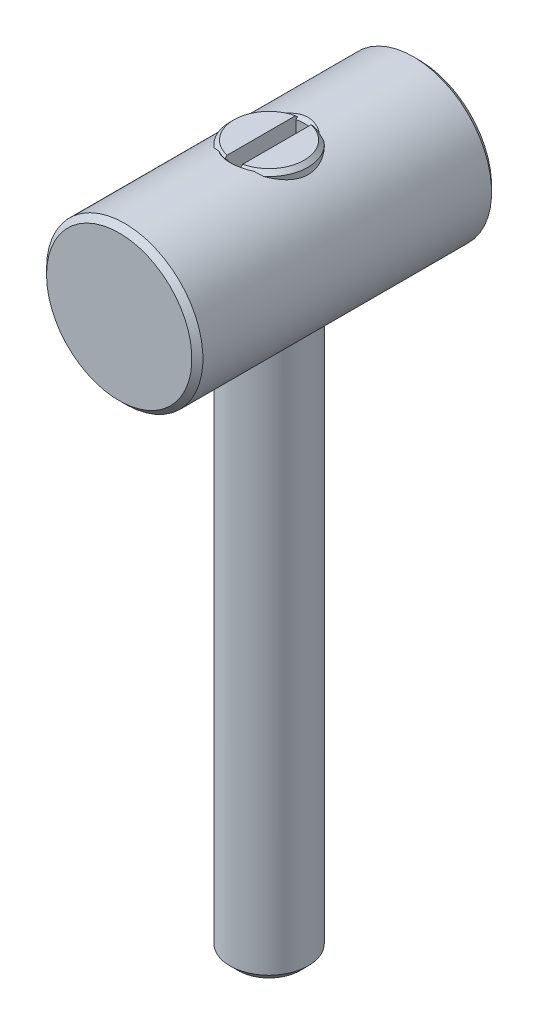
ISO-10303-21;
HEADER;
FILE_DESCRIPTION(('STEP AP214'),'2;1');
FILE_NAME('part.step','',(''),(''),'','','');
FILE_SCHEMA(('AUTOMOTIVE_DESIGN { 1 0 10303 214 1 1 1 1 }'));
ENDSEC;
DATA;
#1=APPLICATION_CONTEXT('core data for automotive mechanical design processes');
#2=APPLICATION_PROTOCOL_DEFINITION('international standard','automotive_design',2000,#1);
#3=PRODUCT_CONTEXT('',#1,'mechanical');
#4=PRODUCT('Part','Part','',(#3));
#5=PRODUCT_RELATED_PRODUCT_CATEGORY('part','',(#4));
#6=PRODUCT_DEFINITION_FORMATION('','',#4);
#7=PRODUCT_DEFINITION_CONTEXT('part definition',#1,'design');
#8=PRODUCT_DEFINITION('design','',#6,#7);
#9=PRODUCT_DEFINITION_SHAPE('','',#8);
#10=(LENGTH_UNIT() NAMED_UNIT(*) SI_UNIT(.MILLI.,.METRE.));
#11=(NAMED_UNIT(*) PLANE_ANGLE_UNIT() SI_UNIT($,.RADIAN.));
#12=(NAMED_UNIT(*) SI_UNIT($,.STERADIAN.) SOLID_ANGLE_UNIT());
#13=UNCERTAINTY_MEASURE_WITH_UNIT(LENGTH_MEASURE(1.E-05),#10,'distance_accuracy_value','');
#14=(GEOMETRIC_REPRESENTATION_CONTEXT(3) GLOBAL_UNCERTAINTY_ASSIGNED_CONTEXT((#13)) GLOBAL_UNIT_ASSIGNED_CONTEXT((#10,
#11,#12)) REPRESENTATION_CONTEXT('',''));
#15=CARTESIAN_POINT('',(0.,0.,0.));
#16=DIRECTION('',(0.,0.,1.));
#17=DIRECTION('',(1.,0.,0.));
#18=AXIS2_PLACEMENT_3D('',#15,#16,#17);
#19=CARTESIAN_POINT('',(0.,-4.,0.));
#20=DIRECTION('',(0.,-1.,0.));
#21=DIRECTION('',(-1.,0.,0.));
#22=AXIS2_PLACEMENT_3D('',#19,#20,#21);
#23=CYLINDRICAL_SURFACE('',#22,1.5);
#24=CARTESIAN_POINT('',(0.947331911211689,2.8465,-1.16299709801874));
#25=CARTESIAN_POINT('',(1.01351143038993,2.82450537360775,-1.10908406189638));
#26=CARTESIAN_POINT('',(1.07489527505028,2.80147999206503,-1.04969000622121));
#27=CARTESIAN_POINT('',(1.18710041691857,2.75580128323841,-0.920938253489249));
#28=CARTESIAN_POINT('',(1.2378650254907,2.73315051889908,-0.851530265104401));
#29=CARTESIAN_POINT('',(1.32722551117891,2.69089876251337,-0.704204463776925));
#30=CARTESIAN_POINT('',(1.36579908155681,2.67130339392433,-0.626271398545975));
#31=CARTESIAN_POINT('',(1.42909401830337,2.63798775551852,-0.46394540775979));
#32=CARTESIAN_POINT('',(1.45385048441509,2.62425262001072,-0.379569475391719));
#33=CARTESIAN_POINT('',(1.48697739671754,2.60561664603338,-0.213368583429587));
#34=CARTESIAN_POINT('',(1.49644089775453,2.60012870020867,-0.131829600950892));
#35=CARTESIAN_POINT('',(1.5018928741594,2.59698536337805,0.0318566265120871));
#36=CARTESIAN_POINT('',(1.49788424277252,2.59932829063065,0.114003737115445));
#37=CARTESIAN_POINT('',(1.47773438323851,2.61082510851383,0.267779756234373));
#38=CARTESIAN_POINT('',(1.4628558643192,2.61926920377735,0.339634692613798));
#39=CARTESIAN_POINT('',(1.42308110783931,2.64108893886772,0.47973567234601));
#40=CARTESIAN_POINT('',(1.39818007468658,2.65446693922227,0.547979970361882));
#41=CARTESIAN_POINT('',(1.33746138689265,2.68559571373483,0.683395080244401));
#42=CARTESIAN_POINT('',(1.30108662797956,2.70355780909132,0.750265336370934));
#43=CARTESIAN_POINT('',(1.21901847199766,2.74153817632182,0.877331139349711));
#44=CARTESIAN_POINT('',(1.17332890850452,2.76155560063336,0.93752941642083));
#45=CARTESIAN_POINT('',(1.09644538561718,2.79260769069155,1.02443697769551));
#46=CARTESIAN_POINT('',(1.06820925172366,2.80355315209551,1.05384666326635));
#47=CARTESIAN_POINT('',(1.00945808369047,2.82523876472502,1.11024632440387));
#48=CARTESIAN_POINT('',(0.978947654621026,2.83597927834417,1.13724095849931));
#49=CARTESIAN_POINT('',(0.947331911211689,2.8465,1.16299709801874));
#50=B_SPLINE_CURVE_WITH_KNOTS('',3,(#24,#25,#26,#27,#28,#29,#30,#31,#32,#33,#34,#35,#36,#37,#38,
#39,#40,#41,#42,#43,#44,#45,#46,#47,#48,#49),.UNSPECIFIED.,.F.,.F.,(4,2,2,2,2,2,2,2,2,2,2,2,4),
(0.,0.264174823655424,0.529725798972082,0.79575989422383,1.06111506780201,1.30649824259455,
1.55182872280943,1.77244859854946,1.99317416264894,2.22691434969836,2.46055853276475,
2.58708455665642,2.71336100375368),.UNSPECIFIED.);
#51=CARTESIAN_POINT('',(0.947331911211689,2.8465,-1.16299709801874));
#52=VERTEX_POINT('',#51);
#53=CARTESIAN_POINT('',(0.947331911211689,2.8465,1.16299709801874));
#54=VERTEX_POINT('',#53);
#55=EDGE_CURVE('E189',#52,#54,#50,.T.);
#56=ORIENTED_EDGE('',*,*,#55,.F.);
#57=CARTESIAN_POINT('',(0.,2.8465,0.));
#58=DIRECTION('',(0.,-1.,0.));
#59=DIRECTION('',(-1.,0.,0.));
#60=AXIS2_PLACEMENT_3D('',#57,#58,#59);
#61=CIRCLE('',#60,1.5);
#62=EDGE_CURVE('E245',#52,#54,#61,.T.);
#63=ORIENTED_EDGE('',*,*,#62,.T.);
#64=EDGE_LOOP('',(#56,#63));
#65=FACE_BOUND('',#64,.T.);
#66=ADVANCED_FACE('F14',(#65),#23,.T.);
#67=CARTESIAN_POINT('',(0.,3.,0.));
#68=DIRECTION('',(0.,-1.,0.));
#69=DIRECTION('',(-1.,0.,0.));
#70=AXIS2_PLACEMENT_3D('',#67,#68,#69);
#71=PLANE('',#70);
#72=DIRECTION('',(0.,0.,1.));
#73=VECTOR('',#72,1.);
#74=CARTESIAN_POINT('',(-0.3,3.,0.));
#75=LINE('',#74,#73);
#76=CARTESIAN_POINT('',(-0.3,3.,-1.31265465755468));
#77=VERTEX_POINT('',#76);
#78=CARTESIAN_POINT('',(-0.3,3.,1.31265465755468));
#79=VERTEX_POINT('',#78);
#80=EDGE_CURVE('E41',#77,#79,#75,.T.);
#81=ORIENTED_EDGE('',*,*,#80,.F.);
#82=CARTESIAN_POINT('',(0.,3.,0.));
#83=DIRECTION('',(0.,-1.,0.));
#84=DIRECTION('',(-1.,0.,0.));
#85=AXIS2_PLACEMENT_3D('',#82,#83,#84);
#86=CIRCLE('',#85,1.3465);
#87=EDGE_CURVE('E272',#79,#77,#86,.T.);
#88=ORIENTED_EDGE('',*,*,#87,.F.);
#89=EDGE_LOOP('',(#81,#88));
#90=FACE_BOUND('',#89,.T.);
#91=ADVANCED_FACE('F217',(#90),#71,.F.);
#92=CARTESIAN_POINT('',(0.,3.,0.));
#93=DIRECTION('',(0.,-1.,0.));
#94=DIRECTION('',(-1.,0.,0.));
#95=AXIS2_PLACEMENT_3D('',#92,#93,#94);
#96=CONICAL_SURFACE('',#95,1.3465,0.785398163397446);
#97=CARTESIAN_POINT('',(-0.992835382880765,2.83095,-1.14506318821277));
#98=CARTESIAN_POINT('',(-0.929590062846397,2.85313590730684,-1.17057691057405));
#99=CARTESIAN_POINT('',(-0.864893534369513,2.87343844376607,-1.19430901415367));
#100=CARTESIAN_POINT('',(-0.733580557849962,2.90971649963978,-1.23716783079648));
#101=CARTESIAN_POINT('',(-0.666989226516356,2.92573258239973,-1.25633751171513));
#102=CARTESIAN_POINT('',(-0.531496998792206,2.95335159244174,-1.28959120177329));
#103=CARTESIAN_POINT('',(-0.46259234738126,2.96494692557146,-1.30366645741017));
#104=CARTESIAN_POINT('',(-0.322550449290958,2.98346059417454,-1.32622709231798));
#105=CARTESIAN_POINT('',(-0.251397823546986,2.99033132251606,-1.33465555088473));
#106=CARTESIAN_POINT('',(-0.1798,2.99460714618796,-1.33988292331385));
#107=B_SPLINE_CURVE_WITH_KNOTS('',3,(#97,#98,#99,#100,#101,#102,#103,#104,#105,#106),
.UNSPECIFIED.,.F.,.F.,(4,2,2,2,4),(0.,0.215180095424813,0.428245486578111,0.64167525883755,
0.85722531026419),.UNSPECIFIED.);
#108=CARTESIAN_POINT('',(-0.947331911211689,2.8465,-1.16299709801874));
#109=VERTEX_POINT('',#108);
#110=CARTESIAN_POINT('',(-0.674247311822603,2.92325,-1.25340780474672));
#111=VERTEX_POINT('',#110);
#112=EDGE_CURVE('E113',#109,#111,#107,.T.);
#113=ORIENTED_EDGE('',*,*,#112,.F.);
#114=CARTESIAN_POINT('',(-0.947331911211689,2.8465,1.16299709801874));
#115=VERTEX_POINT('',#114);
#116=EDGE_CURVE('E243',#115,#109,#61,.T.);
#117=ORIENTED_EDGE('',*,*,#116,.F.);
#118=CARTESIAN_POINT('',(-0.1798,2.99460714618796,1.33988292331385));
#119=CARTESIAN_POINT('',(-0.236038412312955,2.99124022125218,1.335761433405));
#120=CARTESIAN_POINT('',(-0.292017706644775,2.9862800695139,1.3296804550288));
#121=CARTESIAN_POINT('',(-0.403063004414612,2.97332250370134,1.31386344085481));
#122=CARTESIAN_POINT('',(-0.458129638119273,2.96532728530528,1.30413004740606));
#123=CARTESIAN_POINT('',(-0.56626748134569,2.94657689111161,1.28142693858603));
#124=CARTESIAN_POINT('',(-0.619355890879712,2.93586230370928,1.26850488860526));
#125=CARTESIAN_POINT('',(-0.724099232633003,2.91179776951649,1.23969917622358));
#126=CARTESIAN_POINT('',(-0.775754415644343,2.89844828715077,1.22381603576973));
#127=CARTESIAN_POINT('',(-0.854754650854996,2.87580466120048,1.1971455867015));
#128=CARTESIAN_POINT('',(-0.882653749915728,2.86736203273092,1.18725045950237));
#129=CARTESIAN_POINT('',(-0.93806639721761,2.8497157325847,1.16670181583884));
#130=CARTESIAN_POINT('',(-0.96557794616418,2.84050913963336,1.15604541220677));
#131=CARTESIAN_POINT('',(-0.992835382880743,2.83095,1.14506318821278));
#132=B_SPLINE_CURVE_WITH_KNOTS('',3,(#118,#119,#120,#121,#122,#123,#124,#125,#126,#127,#128,
#129,#130,#131),.UNSPECIFIED.,.F.,.F.,(4,2,2,2,2,2,4),(0.,0.169384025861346,0.338645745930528,
0.505516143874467,0.672357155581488,0.764685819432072,0.857385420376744),.UNSPECIFIED.);
#133=CARTESIAN_POINT('',(-0.674247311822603,2.92325,1.25340780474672));
#134=VERTEX_POINT('',#133);
#135=EDGE_CURVE('E119',#134,#115,#132,.T.);
#136=ORIENTED_EDGE('',*,*,#135,.F.);
#137=CARTESIAN_POINT('',(0.,2.92325,0.));
#138=DIRECTION('',(0.,1.,0.));
#139=DIRECTION('',(0.,0.,1.));
#140=AXIS2_PLACEMENT_3D('',#137,#138,#139);
#141=CIRCLE('',#140,1.42325);
#142=CARTESIAN_POINT('',(-0.3,2.92325,1.39127300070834));
#143=VERTEX_POINT('',#142);
#144=EDGE_CURVE('E275',#134,#143,#141,.T.);
#145=ORIENTED_EDGE('',*,*,#144,.T.);
#146=CARTESIAN_POINT('',(-0.3,2.8458,-1.4704082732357));
#147=CARTESIAN_POINT('',(-0.3,2.88115643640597,-1.43432199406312));
#148=CARTESIAN_POINT('',(-0.3,2.91648779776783,-1.39821111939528));
#149=CARTESIAN_POINT('',(-0.3,2.98714018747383,-1.32586601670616));
#150=CARTESIAN_POINT('',(-0.3,3.0224611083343,-1.28963168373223));
#151=CARTESIAN_POINT('',(-0.3,3.09397621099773,-1.21609681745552));
#152=CARTESIAN_POINT('',(-0.3,3.13016808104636,-1.1787940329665));
#153=CARTESIAN_POINT('',(-0.3,3.20237441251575,-1.10413383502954));
#154=CARTESIAN_POINT('',(-0.3,3.23838906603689,-1.06677660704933));
#155=CARTESIAN_POINT('',(-0.3,3.34146505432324,-0.959421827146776));
#156=CARTESIAN_POINT('',(-0.3,3.40833744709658,-0.889241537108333));
#157=CARTESIAN_POINT('',(-0.3,3.50808269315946,-0.78299989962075));
#158=CARTESIAN_POINT('',(-0.3,3.54134564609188,-0.747305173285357));
#159=CARTESIAN_POINT('',(-0.3,3.6074459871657,-0.675572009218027));
#160=CARTESIAN_POINT('',(-0.3,3.64028367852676,-0.639533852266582));
#161=CARTESIAN_POINT('',(-0.3,3.70448937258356,-0.567825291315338));
#162=CARTESIAN_POINT('',(-0.3,3.73587344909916,-0.53216929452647));
#163=CARTESIAN_POINT('',(-0.3,3.79773982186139,-0.459887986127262));
#164=CARTESIAN_POINT('',(-0.3,3.82821923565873,-0.423260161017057));
#165=CARTESIAN_POINT('',(-0.3,3.8723076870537,-0.367400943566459));
#166=CARTESIAN_POINT('',(-0.3,3.88664675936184,-0.348748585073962));
#167=CARTESIAN_POINT('',(-0.3,3.91462683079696,-0.310930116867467));
#168=CARTESIAN_POINT('',(-0.3,3.92826804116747,-0.291764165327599));
#169=CARTESIAN_POINT('',(-0.3,3.95444414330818,-0.252814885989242));
#170=CARTESIAN_POINT('',(-0.3,3.96698388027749,-0.233034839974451));
#171=CARTESIAN_POINT('',(-0.3,3.99041713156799,-0.192530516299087));
#172=CARTESIAN_POINT('',(-0.3,4.00131370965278,-0.171808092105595));
#173=CARTESIAN_POINT('',(-0.3,4.01290967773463,-0.145940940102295));
#174=CARTESIAN_POINT('',(-0.3,4.01488714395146,-0.141366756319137));
#175=CARTESIAN_POINT('',(-0.3,4.01870640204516,-0.132159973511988));
#176=CARTESIAN_POINT('',(-0.3,4.02054813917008,-0.127527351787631));
#177=CARTESIAN_POINT('',(-0.3,4.02584745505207,-0.113544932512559));
#178=CARTESIAN_POINT('',(-0.3,4.02908025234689,-0.104108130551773));
#179=CARTESIAN_POINT('',(-0.3,4.03477287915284,-0.08516895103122));
#180=CARTESIAN_POINT('',(-0.3,4.03724447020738,-0.0756701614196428));
#181=CARTESIAN_POINT('',(-0.3,4.04137161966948,-0.0564948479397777));
#182=CARTESIAN_POINT('',(-0.3,4.04302692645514,-0.0468182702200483));
#183=CARTESIAN_POINT('',(-0.3,4.04664228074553,-0.0172377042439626));
#184=CARTESIAN_POINT('',(-0.3,4.04714068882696,0.00287379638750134));
#185=CARTESIAN_POINT('',(-0.3,4.04412319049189,0.0428030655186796));
#186=CARTESIAN_POINT('',(-0.3,4.0405978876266,0.0626200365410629));
#187=CARTESIAN_POINT('',(-0.3,4.02858082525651,0.108260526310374));
#188=CARTESIAN_POINT('',(-0.3,4.01877038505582,0.133719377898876));
#189=CARTESIAN_POINT('',(-0.3,4.00150485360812,0.170708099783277));
#190=CARTESIAN_POINT('',(-0.3,3.9952966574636,0.182880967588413));
#191=CARTESIAN_POINT('',(-0.3,3.98222681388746,0.206871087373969));
#192=CARTESIAN_POINT('',(-0.3,3.97536538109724,0.218688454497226));
#193=CARTESIAN_POINT('',(-0.3,3.95218871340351,0.256757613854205));
#194=CARTESIAN_POINT('',(-0.3,3.93487575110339,0.282394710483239));
#195=CARTESIAN_POINT('',(-0.3,3.89886611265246,0.332686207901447));
#196=CARTESIAN_POINT('',(-0.3,3.8801680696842,0.357339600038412));
#197=CARTESIAN_POINT('',(-0.3,3.84187863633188,0.40604123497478));
#198=CARTESIAN_POINT('',(-0.3,3.82228508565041,0.430087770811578));
#199=CARTESIAN_POINT('',(-0.3,3.78254416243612,0.477720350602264));
#200=CARTESIAN_POINT('',(-0.3,3.76239671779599,0.501306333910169));
#201=CARTESIAN_POINT('',(-0.3,3.70125985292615,0.571740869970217));
#202=CARTESIAN_POINT('',(-0.3,3.65970988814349,0.618101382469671));
#203=CARTESIAN_POINT('',(-0.3,3.57590945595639,0.710039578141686));
#204=CARTESIAN_POINT('',(-0.3,3.53366022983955,0.75561840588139));
#205=CARTESIAN_POINT('',(-0.3,3.43788259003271,0.857897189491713));
#206=CARTESIAN_POINT('',(-0.3,3.38422190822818,0.914473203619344));
#207=CARTESIAN_POINT('',(-0.3,3.27645519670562,1.02726219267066));
#208=CARTESIAN_POINT('',(-0.3,3.22234892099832,1.08347493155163));
#209=CARTESIAN_POINT('',(-0.3,3.11457978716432,1.19491746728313));
#210=CARTESIAN_POINT('',(-0.3,3.06092031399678,1.25015053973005));
#211=CARTESIAN_POINT('',(-0.3,2.95345728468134,1.36040840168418));
#212=CARTESIAN_POINT('',(-0.3,2.8996538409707,1.41543330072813));
#213=CARTESIAN_POINT('',(-0.3,2.8458,1.4704082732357));
#214=B_SPLINE_CURVE_WITH_KNOTS('',3,(#146,#147,#148,#149,#150,#151,#152,#153,#154,#155,#156,
#157,#158,#159,#160,#161,#162,#163,#164,#165,#166,#167,#168,#169,#170,#171,#172,#173,#174,#175,
#176,#177,#178,#179,#180,#181,#182,#183,#184,#185,#186,#187,#188,#189,#190,#191,#192,#193,#194,
#195,#196,#197,#198,#199,#200,#201,#202,#203,#204,#205,#206,#207,#208,#209,#210,#211,#212,#213),
.UNSPECIFIED.,.F.,.F.,(4,2,2,2,2,2,2,2,2,2,2,2,2,2,2,2,2,2,2,2,2,2,2,2,2,2,2,2,2,2,2,2,2,4),(0.,
0.151560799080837,0.303364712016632,0.459287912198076,0.61495934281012,0.905769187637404,
1.05213984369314,1.19839964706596,1.34089509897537,1.48380422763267,1.5543752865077,
1.62492485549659,1.6951466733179,1.76523589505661,1.78018397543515,1.79513805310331,
1.82503814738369,1.85444992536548,1.88387076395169,1.94377833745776,2.00382609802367,
2.08518752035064,2.12617578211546,2.16715062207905,2.25986253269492,2.35266718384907,
2.44570893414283,2.53876285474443,2.72550711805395,2.91194943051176,3.14587396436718,
3.37993768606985,3.6109572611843,3.84183089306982),.UNSPECIFIED.);
#215=EDGE_CURVE('E240',#79,#143,#214,.T.);
#216=ORIENTED_EDGE('',*,*,#215,.F.);
#217=ORIENTED_EDGE('',*,*,#87,.T.);
#218=CARTESIAN_POINT('',(-0.3,2.92325,-1.39127300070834));
#219=VERTEX_POINT('',#218);
#220=EDGE_CURVE('E37',#219,#77,#214,.T.);
#221=ORIENTED_EDGE('',*,*,#220,.F.);
#222=CARTESIAN_POINT('',(0.,2.92325,0.));
#223=DIRECTION('',(0.,1.,0.));
#224=DIRECTION('',(0.,0.,1.));
#225=AXIS2_PLACEMENT_3D('',#222,#223,#224);
#226=CIRCLE('',#225,1.42325);
#227=EDGE_CURVE('E109',#219,#111,#226,.T.);
#228=ORIENTED_EDGE('',*,*,#227,.T.);
#229=EDGE_LOOP('',(#113,#117,#136,#145,#216,#217,#221,#228));
#230=FACE_BOUND('',#229,.T.);
#231=ADVANCED_FACE('F111',(#230),#96,.T.);
#232=CARTESIAN_POINT('',(0.3,33.3,0.));
#233=DIRECTION('',(-1.,0.,0.));
#234=DIRECTION('',(0.,0.,1.));
#235=AXIS2_PLACEMENT_3D('',#232,#233,#234);
#236=CYLINDRICAL_SURFACE('',#235,31.5);
#237=CARTESIAN_POINT('',(0.3,1.82813733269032,1.33111241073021));
#238=CARTESIAN_POINT('',(0.262266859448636,1.8284977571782,1.33962103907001));
#239=CARTESIAN_POINT('',(0.224170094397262,1.82879235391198,1.34651682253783));
#240=CARTESIAN_POINT('',(0.14752354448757,1.82924457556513,1.35705208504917));
#241=CARTESIAN_POINT('',(0.108973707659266,1.82940218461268,1.36069118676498));
#242=CARTESIAN_POINT('',(0.0324105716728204,1.82957344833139,1.36464401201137));
#243=CARTESIAN_POINT('',(-0.00559964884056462,1.82958968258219,1.3650173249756));
#244=CARTESIAN_POINT('',(-0.0815076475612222,1.82948446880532,1.36259212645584));
#245=CARTESIAN_POINT('',(-0.119405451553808,1.82936305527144,1.35979440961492));
#246=CARTESIAN_POINT('',(-0.205128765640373,1.82893560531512,1.34986012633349));
#247=CARTESIAN_POINT('',(-0.252842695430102,1.8285882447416,1.34174825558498));
#248=CARTESIAN_POINT('',(-0.3,1.82813733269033,1.33111241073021));
#249=B_SPLINE_CURVE_WITH_KNOTS('',3,(#237,#238,#239,#240,#241,#242,#243,#244,#245,#246,#247,
#248),.UNSPECIFIED.,.F.,.F.,(4,2,2,2,2,4),(0.,0.116010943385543,0.232035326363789,
0.345938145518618,0.459812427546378,0.604746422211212),.UNSPECIFIED.);
#250=CARTESIAN_POINT('',(0.3,1.82813733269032,1.33111241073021));
#251=VERTEX_POINT('',#250);
#252=CARTESIAN_POINT('',(-0.3,1.82813733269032,1.33111241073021));
#253=VERTEX_POINT('',#252);
#254=EDGE_CURVE('E301',#251,#253,#249,.T.);
#255=ORIENTED_EDGE('',*,*,#254,.F.);
#256=CARTESIAN_POINT('',(0.3,33.3,0.));
#257=DIRECTION('',(1.,0.,0.));
#258=DIRECTION('',(0.,0.,-1.));
#259=AXIS2_PLACEMENT_3D('',#256,#257,#258);
#260=CIRCLE('',#259,31.5);
#261=CARTESIAN_POINT('',(0.3,1.82813733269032,-1.33111241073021));
#262=VERTEX_POINT('',#261);
#263=EDGE_CURVE('E139',#251,#262,#260,.T.);
#264=ORIENTED_EDGE('',*,*,#263,.T.);
#265=CARTESIAN_POINT('',(-0.3,1.82813733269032,-1.33111241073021));
#266=CARTESIAN_POINT('',(-0.262266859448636,1.8284977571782,-1.33962103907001));
#267=CARTESIAN_POINT('',(-0.224170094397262,1.82879235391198,-1.34651682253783));
#268=CARTESIAN_POINT('',(-0.14752354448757,1.82924457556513,-1.35705208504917));
#269=CARTESIAN_POINT('',(-0.108973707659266,1.82940218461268,-1.36069118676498));
#270=CARTESIAN_POINT('',(-0.0324105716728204,1.82957344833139,-1.36464401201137));
#271=CARTESIAN_POINT('',(0.00559964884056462,1.82958968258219,-1.3650173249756));
#272=CARTESIAN_POINT('',(0.0815076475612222,1.82948446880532,-1.36259212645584));
#273=CARTESIAN_POINT('',(0.119405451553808,1.82936305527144,-1.35979440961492));
#274=CARTESIAN_POINT('',(0.205128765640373,1.82893560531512,-1.34986012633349));
#275=CARTESIAN_POINT('',(0.252842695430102,1.8285882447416,-1.34174825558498));
#276=CARTESIAN_POINT('',(0.3,1.82813733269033,-1.33111241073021));
#277=B_SPLINE_CURVE_WITH_KNOTS('',3,(#265,#266,#267,#268,#269,#270,#271,#272,#273,#274,#275,
#276),.UNSPECIFIED.,.F.,.F.,(4,2,2,2,2,4),(0.,0.116010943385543,0.232035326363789,
0.345938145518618,0.459812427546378,0.604746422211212),.UNSPECIFIED.);
#278=CARTESIAN_POINT('',(-0.3,1.82813733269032,-1.33111241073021));
#279=VERTEX_POINT('',#278);
#280=EDGE_CURVE('E146',#279,#262,#277,.T.);
#281=ORIENTED_EDGE('',*,*,#280,.F.);
#282=CARTESIAN_POINT('',(-0.3,33.3,0.));
#283=DIRECTION('',(1.,0.,0.));
#284=DIRECTION('',(0.,0.,-1.));
#285=AXIS2_PLACEMENT_3D('',#282,#283,#284);
#286=CIRCLE('',#285,31.5);
#287=EDGE_CURVE('E134',#253,#279,#286,.T.);
#288=ORIENTED_EDGE('',*,*,#287,.F.);
#289=EDGE_LOOP('',(#255,#264,#281,#288));
#290=FACE_BOUND('',#289,.T.);
#291=ADVANCED_FACE('F216',(#290),#236,.F.);
#292=CARTESIAN_POINT('',(-0.3,33.3,0.));
#293=DIRECTION('',(1.,0.,0.));
#294=DIRECTION('',(0.,0.,-1.));
#295=AXIS2_PLACEMENT_3D('',#292,#293,#294);
#296=PLANE('',#295);
#297=CARTESIAN_POINT('',(-0.3,2.23530206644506,0.671318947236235));
#298=CARTESIAN_POINT('',(-0.3,2.25951576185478,0.697833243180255));
#299=CARTESIAN_POINT('',(-0.3,2.28385163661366,0.724235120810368));
#300=CARTESIAN_POINT('',(-0.3,2.33271486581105,0.776860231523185));
#301=CARTESIAN_POINT('',(-0.3,2.35724221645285,0.803083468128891));
#302=CARTESIAN_POINT('',(-0.3,2.43103122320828,0.881553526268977));
#303=CARTESIAN_POINT('',(-0.3,2.48050219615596,0.933603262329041));
#304=CARTESIAN_POINT('',(-0.3,2.57977835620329,1.03737516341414));
#305=CARTESIAN_POINT('',(-0.3,2.62958351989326,1.08909735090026));
#306=CARTESIAN_POINT('',(-0.3,2.72941861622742,1.19232568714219));
#307=CARTESIAN_POINT('',(-0.3,2.77944855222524,1.24383183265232));
#308=CARTESIAN_POINT('',(-0.3,2.94833708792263,1.41719880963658));
#309=CARTESIAN_POINT('',(-0.3,3.06754094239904,1.53872304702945));
#310=CARTESIAN_POINT('',(-0.3,3.24664716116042,1.72072148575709));
#311=CARTESIAN_POINT('',(-0.3,3.30640150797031,1.78134186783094));
#312=CARTESIAN_POINT('',(-0.3,3.42598789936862,1.9025053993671));
#313=CARTESIAN_POINT('',(-0.3,3.4858199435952,1.9630485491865));
#314=CARTESIAN_POINT('',(-0.3,3.54568061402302,2.02356348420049));
#315=B_SPLINE_CURVE_WITH_KNOTS('',3,(#297,#298,#299,#300,#301,#302,#303,#304,#305,#306,#307,
#308,#309,#310,#311,#312,#313,#314),.UNSPECIFIED.,.F.,.F.,(4,2,2,2,2,2,2,2,4),(0.,
0.107719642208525,0.215437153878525,0.430861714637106,0.646271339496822,0.861684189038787,
1.37236666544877,1.62772666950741,1.88308548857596),.UNSPECIFIED.);
#316=CARTESIAN_POINT('',(-0.3,2.8645,1.33111241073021));
#317=VERTEX_POINT('',#316);
#318=EDGE_CURVE('E255',#317,#143,#315,.T.);
#319=ORIENTED_EDGE('',*,*,#318,.F.);
#320=DIRECTION('',(0.,-1.,0.));
#321=VECTOR('',#320,1.);
#322=CARTESIAN_POINT('',(-0.3,-3.,1.33111241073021));
#323=LINE('',#322,#321);
#324=EDGE_CURVE('E210',#253,#317,#323,.F.);
#325=ORIENTED_EDGE('',*,*,#324,.F.);
#326=ORIENTED_EDGE('',*,*,#287,.T.);
#327=DIRECTION('',(0.,-1.,0.));
#328=VECTOR('',#327,1.);
#329=CARTESIAN_POINT('',(-0.3,-3.,-1.33111241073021));
#330=LINE('',#329,#328);
#331=CARTESIAN_POINT('',(-0.3,2.8645,-1.33111241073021));
#332=VERTEX_POINT('',#331);
#333=EDGE_CURVE('E246',#332,#279,#330,.T.);
#334=ORIENTED_EDGE('',*,*,#333,.F.);
#335=CARTESIAN_POINT('',(-0.3,3.54348929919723,-2.02134819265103));
#336=CARTESIAN_POINT('',(-0.3,3.48857377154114,-1.96583089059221));
#337=CARTESIAN_POINT('',(-0.3,3.43368230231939,-1.91028984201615));
#338=CARTESIAN_POINT('',(-0.3,3.32396337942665,-1.79914422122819));
#339=CARTESIAN_POINT('',(-0.3,3.26913592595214,-1.74353964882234));
#340=CARTESIAN_POINT('',(-0.3,3.10478055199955,-1.57661382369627));
#341=CARTESIAN_POINT('',(-0.3,2.99537298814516,-1.46517376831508));
#342=CARTESIAN_POINT('',(-0.3,2.83172644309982,-1.29755058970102));
#343=CARTESIAN_POINT('',(-0.3,2.77725282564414,-1.241596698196));
#344=CARTESIAN_POINT('',(-0.3,2.66854234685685,-1.1294608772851));
#345=CARTESIAN_POINT('',(-0.3,2.6143054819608,-1.07327895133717));
#346=CARTESIAN_POINT('',(-0.3,2.506191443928,-0.960561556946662));
#347=CARTESIAN_POINT('',(-0.3,2.45231429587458,-0.904026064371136));
#348=CARTESIAN_POINT('',(-0.3,2.37196128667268,-0.81878330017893));
#349=CARTESIAN_POINT('',(-0.3,2.34525340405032,-0.790295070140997));
#350=CARTESIAN_POINT('',(-0.3,2.29205508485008,-0.733115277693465));
#351=CARTESIAN_POINT('',(-0.3,2.26556465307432,-0.70442371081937));
#352=CARTESIAN_POINT('',(-0.3,2.23921490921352,-0.675602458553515));
#353=B_SPLINE_CURVE_WITH_KNOTS('',3,(#335,#336,#337,#338,#339,#340,#341,#342,#343,#344,#345,
#346,#347,#348,#349,#350,#351,#352),.UNSPECIFIED.,.F.,.F.,(4,2,2,2,2,2,2,2,4),(0.,
0.234266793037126,0.468534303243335,0.937041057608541,1.17131374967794,1.40558290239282,
1.63986822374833,1.75701676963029,1.87416789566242),.UNSPECIFIED.);
#354=EDGE_CURVE('E248',#219,#332,#353,.T.);
#355=ORIENTED_EDGE('',*,*,#354,.F.);
#356=ORIENTED_EDGE('',*,*,#220,.T.);
#357=ORIENTED_EDGE('',*,*,#80,.T.);
#358=ORIENTED_EDGE('',*,*,#215,.T.);
#359=EDGE_LOOP('',(#319,#325,#326,#334,#355,#356,#357,#358));
#360=FACE_BOUND('',#359,.T.);
#361=ADVANCED_FACE('F162',(#360),#296,.T.);
#362=CARTESIAN_POINT('',(0.3,3.,-1.31265465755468));
#363=VERTEX_POINT('',#362);
#364=CARTESIAN_POINT('',(0.3,3.,1.31265465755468));
#365=VERTEX_POINT('',#364);
#366=EDGE_CURVE('E247',#363,#365,#86,.T.);
#367=ORIENTED_EDGE('',*,*,#366,.F.);
#368=DIRECTION('',(0.,0.,1.));
#369=VECTOR('',#368,1.);
#370=CARTESIAN_POINT('',(0.3,3.,0.));
#371=LINE('',#370,#369);
#372=EDGE_CURVE('E241',#363,#365,#371,.T.);
#373=ORIENTED_EDGE('',*,*,#372,.T.);
#374=EDGE_LOOP('',(#367,#373));
#375=FACE_BOUND('',#374,.T.);
#376=ADVANCED_FACE('F219',(#375),#71,.F.);
#377=CARTESIAN_POINT('',(0.1798,2.99460714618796,-1.33988292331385));
#378=CARTESIAN_POINT('',(0.236038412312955,2.99124022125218,-1.335761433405));
#379=CARTESIAN_POINT('',(0.292017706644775,2.9862800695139,-1.3296804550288));
#380=CARTESIAN_POINT('',(0.403063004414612,2.97332250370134,-1.31386344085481));
#381=CARTESIAN_POINT('',(0.458129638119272,2.96532728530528,-1.30413004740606));
#382=CARTESIAN_POINT('',(0.566267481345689,2.94657689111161,-1.28142693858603));
#383=CARTESIAN_POINT('',(0.619355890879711,2.93586230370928,-1.26850488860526));
#384=CARTESIAN_POINT('',(0.724099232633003,2.91179776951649,-1.23969917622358));
#385=CARTESIAN_POINT('',(0.775754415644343,2.89844828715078,-1.22381603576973));
#386=CARTESIAN_POINT('',(0.854754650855,2.87580466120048,-1.1971455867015));
#387=CARTESIAN_POINT('',(0.882653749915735,2.86736203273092,-1.18725045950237));
#388=CARTESIAN_POINT('',(0.938066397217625,2.8497157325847,-1.16670181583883));
#389=CARTESIAN_POINT('',(0.965577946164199,2.84050913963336,-1.15604541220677));
#390=CARTESIAN_POINT('',(0.992835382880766,2.83095,-1.14506318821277));
#391=B_SPLINE_CURVE_WITH_KNOTS('',3,(#377,#378,#379,#380,#381,#382,#383,#384,#385,#386,#387,
#388,#389,#390),.UNSPECIFIED.,.F.,.F.,(4,2,2,2,2,2,4),(0.,0.169384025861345,0.338645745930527,
0.505516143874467,0.672357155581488,0.764685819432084,0.857385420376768),.UNSPECIFIED.);
#392=CARTESIAN_POINT('',(0.674247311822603,2.92325,-1.25340780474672));
#393=VERTEX_POINT('',#392);
#394=EDGE_CURVE('E196',#393,#52,#391,.T.);
#395=ORIENTED_EDGE('',*,*,#394,.F.);
#396=CARTESIAN_POINT('',(0.,2.92325,0.));
#397=DIRECTION('',(0.,1.,0.));
#398=DIRECTION('',(0.,0.,1.));
#399=AXIS2_PLACEMENT_3D('',#396,#397,#398);
#400=CIRCLE('',#399,1.42325);
#401=CARTESIAN_POINT('',(0.3,2.92325,-1.39127300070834));
#402=VERTEX_POINT('',#401);
#403=EDGE_CURVE('E132',#393,#402,#400,.T.);
#404=ORIENTED_EDGE('',*,*,#403,.T.);
#405=CARTESIAN_POINT('',(0.3,2.8458,-1.4704082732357));
#406=CARTESIAN_POINT('',(0.3,2.88115643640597,-1.43432199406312));
#407=CARTESIAN_POINT('',(0.3,2.91648779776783,-1.39821111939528));
#408=CARTESIAN_POINT('',(0.3,2.98714018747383,-1.32586601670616));
#409=CARTESIAN_POINT('',(0.3,3.0224611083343,-1.28963168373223));
#410=CARTESIAN_POINT('',(0.3,3.09397621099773,-1.21609681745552));
#411=CARTESIAN_POINT('',(0.3,3.13016808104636,-1.1787940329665));
#412=CARTESIAN_POINT('',(0.3,3.20237441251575,-1.10413383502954));
#413=CARTESIAN_POINT('',(0.3,3.23838906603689,-1.06677660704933));
#414=CARTESIAN_POINT('',(0.3,3.34146505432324,-0.959421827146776));
#415=CARTESIAN_POINT('',(0.3,3.40833744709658,-0.889241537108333));
#416=CARTESIAN_POINT('',(0.3,3.50808269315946,-0.78299989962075));
#417=CARTESIAN_POINT('',(0.3,3.54134564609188,-0.747305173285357));
#418=CARTESIAN_POINT('',(0.3,3.6074459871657,-0.675572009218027));
#419=CARTESIAN_POINT('',(0.3,3.64028367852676,-0.639533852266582));
#420=CARTESIAN_POINT('',(0.3,3.70448937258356,-0.567825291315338));
#421=CARTESIAN_POINT('',(0.3,3.73587344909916,-0.53216929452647));
#422=CARTESIAN_POINT('',(0.3,3.79773982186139,-0.459887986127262));
#423=CARTESIAN_POINT('',(0.3,3.82821923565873,-0.423260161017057));
#424=CARTESIAN_POINT('',(0.3,3.8723076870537,-0.367400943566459));
#425=CARTESIAN_POINT('',(0.3,3.88664675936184,-0.348748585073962));
#426=CARTESIAN_POINT('',(0.3,3.91462683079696,-0.310930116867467));
#427=CARTESIAN_POINT('',(0.3,3.92826804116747,-0.291764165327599));
#428=CARTESIAN_POINT('',(0.3,3.95444414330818,-0.252814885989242));
#429=CARTESIAN_POINT('',(0.3,3.96698388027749,-0.233034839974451));
#430=CARTESIAN_POINT('',(0.3,3.99041713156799,-0.192530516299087));
#431=CARTESIAN_POINT('',(0.3,4.00131370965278,-0.171808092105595));
#432=CARTESIAN_POINT('',(0.3,4.01290967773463,-0.145940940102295));
#433=CARTESIAN_POINT('',(0.3,4.01488714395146,-0.141366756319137));
#434=CARTESIAN_POINT('',(0.3,4.01870640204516,-0.132159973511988));
#435=CARTESIAN_POINT('',(0.3,4.02054813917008,-0.127527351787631));
#436=CARTESIAN_POINT('',(0.3,4.02584745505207,-0.113544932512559));
#437=CARTESIAN_POINT('',(0.3,4.02908025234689,-0.104108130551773));
#438=CARTESIAN_POINT('',(0.3,4.03477287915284,-0.08516895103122));
#439=CARTESIAN_POINT('',(0.3,4.03724447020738,-0.0756701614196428));
#440=CARTESIAN_POINT('',(0.3,4.04137161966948,-0.0564948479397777));
#441=CARTESIAN_POINT('',(0.3,4.04302692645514,-0.0468182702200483));
#442=CARTESIAN_POINT('',(0.3,4.04664228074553,-0.0172377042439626));
#443=CARTESIAN_POINT('',(0.3,4.04714068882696,0.00287379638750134));
#444=CARTESIAN_POINT('',(0.3,4.04412319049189,0.0428030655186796));
#445=CARTESIAN_POINT('',(0.3,4.0405978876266,0.0626200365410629));
#446=CARTESIAN_POINT('',(0.3,4.02858082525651,0.108260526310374));
#447=CARTESIAN_POINT('',(0.3,4.01877038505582,0.133719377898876));
#448=CARTESIAN_POINT('',(0.3,4.00150485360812,0.170708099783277));
#449=CARTESIAN_POINT('',(0.3,3.9952966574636,0.182880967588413));
#450=CARTESIAN_POINT('',(0.3,3.98222681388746,0.206871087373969));
#451=CARTESIAN_POINT('',(0.3,3.97536538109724,0.218688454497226));
#452=CARTESIAN_POINT('',(0.3,3.95218871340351,0.256757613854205));
#453=CARTESIAN_POINT('',(0.3,3.93487575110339,0.282394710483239));
#454=CARTESIAN_POINT('',(0.3,3.89886611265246,0.332686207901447));
#455=CARTESIAN_POINT('',(0.3,3.8801680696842,0.357339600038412));
#456=CARTESIAN_POINT('',(0.3,3.84187863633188,0.40604123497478));
#457=CARTESIAN_POINT('',(0.3,3.82228508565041,0.430087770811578));
#458=CARTESIAN_POINT('',(0.3,3.78254416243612,0.477720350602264));
#459=CARTESIAN_POINT('',(0.3,3.76239671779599,0.501306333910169));
#460=CARTESIAN_POINT('',(0.3,3.70125985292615,0.571740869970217));
#461=CARTESIAN_POINT('',(0.3,3.65970988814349,0.618101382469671));
#462=CARTESIAN_POINT('',(0.3,3.57590945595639,0.710039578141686));
#463=CARTESIAN_POINT('',(0.3,3.53366022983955,0.75561840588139));
#464=CARTESIAN_POINT('',(0.3,3.43788259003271,0.857897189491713));
#465=CARTESIAN_POINT('',(0.3,3.38422190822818,0.914473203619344));
#466=CARTESIAN_POINT('',(0.3,3.27645519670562,1.02726219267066));
#467=CARTESIAN_POINT('',(0.3,3.22234892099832,1.08347493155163));
#468=CARTESIAN_POINT('',(0.3,3.11457978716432,1.19491746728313));
#469=CARTESIAN_POINT('',(0.3,3.06092031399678,1.25015053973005));
#470=CARTESIAN_POINT('',(0.3,2.95345728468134,1.36040840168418));
#471=CARTESIAN_POINT('',(0.3,2.8996538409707,1.41543330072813));
#472=CARTESIAN_POINT('',(0.3,2.8458,1.4704082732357));
#473=B_SPLINE_CURVE_WITH_KNOTS('',3,(#405,#406,#407,#408,#409,#410,#411,#412,#413,#414,#415,
#416,#417,#418,#419,#420,#421,#422,#423,#424,#425,#426,#427,#428,#429,#430,#431,#432,#433,#434,
#435,#436,#437,#438,#439,#440,#441,#442,#443,#444,#445,#446,#447,#448,#449,#450,#451,#452,#453,
#454,#455,#456,#457,#458,#459,#460,#461,#462,#463,#464,#465,#466,#467,#468,#469,#470,#471,#472),
.UNSPECIFIED.,.F.,.F.,(4,2,2,2,2,2,2,2,2,2,2,2,2,2,2,2,2,2,2,2,2,2,2,2,2,2,2,2,2,2,2,2,2,4),(0.,
0.151560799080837,0.303364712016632,0.459287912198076,0.61495934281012,0.905769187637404,
1.05213984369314,1.19839964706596,1.34089509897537,1.48380422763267,1.5543752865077,
1.62492485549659,1.6951466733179,1.76523589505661,1.78018397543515,1.79513805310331,
1.82503814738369,1.85444992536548,1.88387076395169,1.94377833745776,2.00382609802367,
2.08518752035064,2.12617578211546,2.16715062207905,2.25986253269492,2.35266718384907,
2.44570893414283,2.53876285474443,2.72550711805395,2.91194943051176,3.14587396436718,
3.37993768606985,3.6109572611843,3.84183089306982),.UNSPECIFIED.);
#474=EDGE_CURVE('E233',#402,#363,#473,.T.);
#475=ORIENTED_EDGE('',*,*,#474,.T.);
#476=ORIENTED_EDGE('',*,*,#366,.T.);
#477=CARTESIAN_POINT('',(0.3,2.92325,1.39127300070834));
#478=VERTEX_POINT('',#477);
#479=EDGE_CURVE('E242',#365,#478,#473,.T.);
#480=ORIENTED_EDGE('',*,*,#479,.T.);
#481=CARTESIAN_POINT('',(0.,2.92325,0.));
#482=DIRECTION('',(0.,1.,0.));
#483=DIRECTION('',(0.,0.,1.));
#484=AXIS2_PLACEMENT_3D('',#481,#482,#483);
#485=CIRCLE('',#484,1.42325);
#486=CARTESIAN_POINT('',(0.674247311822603,2.92325,1.25340780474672));
#487=VERTEX_POINT('',#486);
#488=EDGE_CURVE('E209',#478,#487,#485,.T.);
#489=ORIENTED_EDGE('',*,*,#488,.T.);
#490=CARTESIAN_POINT('',(0.992835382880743,2.83095,1.14506318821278));
#491=CARTESIAN_POINT('',(0.929590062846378,2.85313590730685,1.17057691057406));
#492=CARTESIAN_POINT('',(0.864893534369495,2.87343844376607,1.19430901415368));
#493=CARTESIAN_POINT('',(0.733580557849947,2.90971649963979,1.23716783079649));
#494=CARTESIAN_POINT('',(0.666989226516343,2.92573258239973,1.25633751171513));
#495=CARTESIAN_POINT('',(0.531496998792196,2.95335159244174,1.28959120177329));
#496=CARTESIAN_POINT('',(0.462592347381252,2.96494692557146,1.30366645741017));
#497=CARTESIAN_POINT('',(0.322550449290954,2.98346059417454,1.32622709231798));
#498=CARTESIAN_POINT('',(0.251397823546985,2.99033132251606,1.33465555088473));
#499=CARTESIAN_POINT('',(0.1798,2.99460714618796,1.33988292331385));
#500=B_SPLINE_CURVE_WITH_KNOTS('',3,(#490,#491,#492,#493,#494,#495,#496,#497,#498,#499),
.UNSPECIFIED.,.F.,.F.,(4,2,2,2,4),(0.,0.215180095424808,0.428245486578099,0.641675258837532,
0.857225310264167),.UNSPECIFIED.);
#501=EDGE_CURVE('E202',#54,#487,#500,.T.);
#502=ORIENTED_EDGE('',*,*,#501,.F.);
#503=ORIENTED_EDGE('',*,*,#62,.F.);
#504=EDGE_LOOP('',(#395,#404,#475,#476,#480,#489,#502,#503));
#505=FACE_BOUND('',#504,.T.);
#506=ADVANCED_FACE('F218',(#505),#96,.T.);
#507=CARTESIAN_POINT('',(0.3,33.3,0.));
#508=DIRECTION('',(1.,0.,0.));
#509=DIRECTION('',(0.,0.,-1.));
#510=AXIS2_PLACEMENT_3D('',#507,#508,#509);
#511=PLANE('',#510);
#512=DIRECTION('',(0.,-1.,0.));
#513=VECTOR('',#512,1.);
#514=CARTESIAN_POINT('',(0.3,-3.,1.33111241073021));
#515=LINE('',#514,#513);
#516=CARTESIAN_POINT('',(0.3,2.8645,1.33111241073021));
#517=VERTEX_POINT('',#516);
#518=EDGE_CURVE('E500',#251,#517,#515,.F.);
#519=ORIENTED_EDGE('',*,*,#518,.T.);
#520=CARTESIAN_POINT('',(0.3,2.23530206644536,0.671318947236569));
#521=CARTESIAN_POINT('',(0.3,2.25951576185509,0.697833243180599));
#522=CARTESIAN_POINT('',(0.3,2.28385163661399,0.724235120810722));
#523=CARTESIAN_POINT('',(0.3,2.3327148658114,0.776860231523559));
#524=CARTESIAN_POINT('',(0.3,2.35724221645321,0.803083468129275));
#525=CARTESIAN_POINT('',(0.3,2.43103122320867,0.881553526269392));
#526=CARTESIAN_POINT('',(0.3,2.48050219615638,0.933603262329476));
#527=CARTESIAN_POINT('',(0.3,2.57977835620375,1.03737516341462));
#528=CARTESIAN_POINT('',(0.3,2.62958351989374,1.08909735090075));
#529=CARTESIAN_POINT('',(0.3,2.72941861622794,1.19232568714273));
#530=CARTESIAN_POINT('',(0.3,2.77944855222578,1.24383183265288));
#531=CARTESIAN_POINT('',(0.3,2.94833708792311,1.41719880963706));
#532=CARTESIAN_POINT('',(0.3,3.06754094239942,1.53872304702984));
#533=CARTESIAN_POINT('',(0.3,3.24664716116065,1.72072148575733));
#534=CARTESIAN_POINT('',(0.3,3.3064015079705,1.78134186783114));
#535=CARTESIAN_POINT('',(0.3,3.42598789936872,1.9025053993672));
#536=CARTESIAN_POINT('',(0.3,3.48581994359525,1.96304854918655));
#537=CARTESIAN_POINT('',(0.3,3.54568061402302,2.02356348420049));
#538=B_SPLINE_CURVE_WITH_KNOTS('',3,(#520,#521,#522,#523,#524,#525,#526,#527,#528,#529,#530,
#531,#532,#533,#534,#535,#536,#537),.UNSPECIFIED.,.F.,.F.,(4,2,2,2,2,2,2,2,4),(0.,
0.107719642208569,0.215437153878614,0.430861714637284,0.646271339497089,0.861684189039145,
1.37236666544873,1.62772666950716,1.88308548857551),.UNSPECIFIED.);
#539=EDGE_CURVE('E494',#517,#478,#538,.T.);
#540=ORIENTED_EDGE('',*,*,#539,.T.);
#541=ORIENTED_EDGE('',*,*,#479,.F.);
#542=ORIENTED_EDGE('',*,*,#372,.F.);
#543=ORIENTED_EDGE('',*,*,#474,.F.);
#544=CARTESIAN_POINT('',(0.3,3.54348929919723,-2.02134819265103));
#545=CARTESIAN_POINT('',(0.3,3.48857377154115,-1.96583089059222));
#546=CARTESIAN_POINT('',(0.3,3.43368230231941,-1.91028984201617));
#547=CARTESIAN_POINT('',(0.3,3.3239633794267,-1.79914422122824));
#548=CARTESIAN_POINT('',(0.3,3.2691359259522,-1.7435396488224));
#549=CARTESIAN_POINT('',(0.3,3.10478055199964,-1.57661382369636));
#550=CARTESIAN_POINT('',(0.3,2.99537298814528,-1.4651737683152));
#551=CARTESIAN_POINT('',(0.3,2.83172644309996,-1.29755058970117));
#552=CARTESIAN_POINT('',(0.3,2.77725282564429,-1.24159669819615));
#553=CARTESIAN_POINT('',(0.3,2.66854234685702,-1.12946087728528));
#554=CARTESIAN_POINT('',(0.3,2.61430548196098,-1.07327895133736));
#555=CARTESIAN_POINT('',(0.3,2.50619144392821,-0.960561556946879));
#556=CARTESIAN_POINT('',(0.3,2.4523142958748,-0.904026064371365));
#557=CARTESIAN_POINT('',(0.3,2.37196128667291,-0.818783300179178));
#558=CARTESIAN_POINT('',(0.3,2.34525340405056,-0.790295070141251));
#559=CARTESIAN_POINT('',(0.3,2.29205508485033,-0.733115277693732));
#560=CARTESIAN_POINT('',(0.3,2.26556465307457,-0.704423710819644));
#561=CARTESIAN_POINT('',(0.3,2.23921490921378,-0.675602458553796));
#562=B_SPLINE_CURVE_WITH_KNOTS('',3,(#544,#545,#546,#547,#548,#549,#550,#551,#552,#553,#554,
#555,#556,#557,#558,#559,#560,#561),.UNSPECIFIED.,.F.,.F.,(4,2,2,2,2,2,2,2,4),(0.,
0.234266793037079,0.46853430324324,0.937041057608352,1.1713137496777,1.40558290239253,
1.639868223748,1.75701676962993,1.87416789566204),.UNSPECIFIED.);
#563=CARTESIAN_POINT('',(0.3,2.8645,-1.33111241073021));
#564=VERTEX_POINT('',#563);
#565=EDGE_CURVE('E265',#402,#564,#562,.T.);
#566=ORIENTED_EDGE('',*,*,#565,.T.);
#567=DIRECTION('',(0.,-1.,0.));
#568=VECTOR('',#567,1.);
#569=CARTESIAN_POINT('',(0.3,-3.,-1.33111241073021));
#570=LINE('',#569,#568);
#571=EDGE_CURVE('E260',#564,#262,#570,.T.);
#572=ORIENTED_EDGE('',*,*,#571,.T.);
#573=ORIENTED_EDGE('',*,*,#263,.F.);
#574=EDGE_LOOP('',(#519,#540,#541,#542,#543,#566,#572,#573));
#575=FACE_BOUND('',#574,.T.);
#576=ADVANCED_FACE('F221',(#575),#511,.F.);
#577=CARTESIAN_POINT('',(-0.947331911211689,2.8465,1.16299709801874));
#578=CARTESIAN_POINT('',(-1.01351143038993,2.82450537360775,1.10908406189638));
#579=CARTESIAN_POINT('',(-1.07489527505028,2.80147999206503,1.04969000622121));
#580=CARTESIAN_POINT('',(-1.18710041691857,2.75580128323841,0.920938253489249));
#581=CARTESIAN_POINT('',(-1.2378650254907,2.73315051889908,0.851530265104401));
#582=CARTESIAN_POINT('',(-1.32722551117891,2.69089876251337,0.704204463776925));
#583=CARTESIAN_POINT('',(-1.36579908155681,2.67130339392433,0.626271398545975));
#584=CARTESIAN_POINT('',(-1.42909401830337,2.63798775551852,0.46394540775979));
#585=CARTESIAN_POINT('',(-1.45385048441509,2.62425262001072,0.379569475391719));
#586=CARTESIAN_POINT('',(-1.48697739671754,2.60561664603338,0.213368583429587));
#587=CARTESIAN_POINT('',(-1.49644089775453,2.60012870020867,0.131829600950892));
#588=CARTESIAN_POINT('',(-1.5018928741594,2.59698536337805,-0.0318566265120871));
#589=CARTESIAN_POINT('',(-1.49788424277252,2.59932829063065,-0.114003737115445));
#590=CARTESIAN_POINT('',(-1.47773438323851,2.61082510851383,-0.267779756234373));
#591=CARTESIAN_POINT('',(-1.4628558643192,2.61926920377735,-0.339634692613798));
#592=CARTESIAN_POINT('',(-1.42308110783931,2.64108893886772,-0.47973567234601));
#593=CARTESIAN_POINT('',(-1.39818007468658,2.65446693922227,-0.547979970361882));
#594=CARTESIAN_POINT('',(-1.33746138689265,2.68559571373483,-0.683395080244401));
#595=CARTESIAN_POINT('',(-1.30108662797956,2.70355780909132,-0.750265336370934));
#596=CARTESIAN_POINT('',(-1.21901847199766,2.74153817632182,-0.877331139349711));
#597=CARTESIAN_POINT('',(-1.17332890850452,2.76155560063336,-0.93752941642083));
#598=CARTESIAN_POINT('',(-1.09644538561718,2.79260769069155,-1.02443697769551));
#599=CARTESIAN_POINT('',(-1.06820925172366,2.80355315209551,-1.05384666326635));
#600=CARTESIAN_POINT('',(-1.00945808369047,2.82523876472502,-1.11024632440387));
#601=CARTESIAN_POINT('',(-0.978947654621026,2.83597927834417,-1.13724095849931));
#602=CARTESIAN_POINT('',(-0.947331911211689,2.8465,-1.16299709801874));
#603=B_SPLINE_CURVE_WITH_KNOTS('',3,(#577,#578,#579,#580,#581,#582,#583,#584,#585,#586,#587,
#588,#589,#590,#591,#592,#593,#594,#595,#596,#597,#598,#599,#600,#601,#602),.UNSPECIFIED.,.F.,
.F.,(4,2,2,2,2,2,2,2,2,2,2,2,4),(0.,0.264174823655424,0.529725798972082,0.79575989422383,
1.06111506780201,1.30649824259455,1.55182872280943,1.77244859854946,1.99317416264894,
2.22691434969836,2.46055853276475,2.58708455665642,2.71336100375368),.UNSPECIFIED.);
#604=EDGE_CURVE('E126',#115,#109,#603,.T.);
#605=ORIENTED_EDGE('',*,*,#604,.F.);
#606=ORIENTED_EDGE('',*,*,#116,.T.);
#607=EDGE_LOOP('',(#605,#606));
#608=FACE_BOUND('',#607,.T.);
#609=ADVANCED_FACE('F160',(#608),#23,.T.);
#610=CARTESIAN_POINT('',(-1.5,-2.59807621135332,0.));
#611=CARTESIAN_POINT('',(-1.4999945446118,-2.59808302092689,0.0781617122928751));
#612=CARTESIAN_POINT('',(-1.49384995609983,-2.60165701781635,0.156422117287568));
#613=CARTESIAN_POINT('',(-1.46958481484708,-2.61543549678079,0.310540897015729));
#614=CARTESIAN_POINT('',(-1.45143909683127,-2.62565391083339,0.386393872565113));
#615=CARTESIAN_POINT('',(-1.40414992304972,-2.65124019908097,0.533177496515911));
#616=CARTESIAN_POINT('',(-1.3750649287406,-2.66658065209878,0.60413197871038));
#617=CARTESIAN_POINT('',(-1.30690128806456,-2.70063997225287,0.740136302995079));
#618=CARTESIAN_POINT('',(-1.26782210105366,-2.71935902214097,0.805185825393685));
#619=CARTESIAN_POINT('',(-1.17699981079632,-2.75995303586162,0.933458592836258));
#620=CARTESIAN_POINT('',(-1.12447805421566,-2.7819609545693,0.996088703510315));
#621=CARTESIAN_POINT('',(-1.0098807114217,-2.82557974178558,1.11211258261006));
#622=CARTESIAN_POINT('',(-0.94780038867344,-2.84719040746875,1.16550174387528));
#623=CARTESIAN_POINT('',(-0.81073434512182,-2.88932215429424,1.26505072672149));
#624=CARTESIAN_POINT('',(-0.735160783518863,-2.90967159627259,1.31048065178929));
#625=CARTESIAN_POINT('',(-0.576235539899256,-2.94526134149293,1.38771127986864));
#626=CARTESIAN_POINT('',(-0.492888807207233,-2.96050486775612,1.41952058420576));
#627=CARTESIAN_POINT('',(-0.327067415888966,-2.98320691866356,1.46625699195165));
#628=CARTESIAN_POINT('',(-0.244952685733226,-2.99114220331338,1.4822242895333));
#629=CARTESIAN_POINT('',(-0.0788559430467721,-3.00011375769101,1.50024917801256));
#630=CARTESIAN_POINT('',(0.00512490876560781,-3.00115420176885,1.50231518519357));
#631=CARTESIAN_POINT('',(0.164748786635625,-2.99644472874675,1.49287998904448));
#632=CARTESIAN_POINT('',(0.240481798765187,-2.99127743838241,1.48254297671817));
#633=CARTESIAN_POINT('',(0.388970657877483,-2.97561367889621,1.45067873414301));
#634=CARTESIAN_POINT('',(0.461726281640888,-2.96511681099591,1.42915066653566));
#635=CARTESIAN_POINT('',(0.60346408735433,-2.93957374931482,1.37537615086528));
#636=CARTESIAN_POINT('',(0.672380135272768,-2.92446662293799,1.3429855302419));
#637=CARTESIAN_POINT('',(0.803965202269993,-2.89106468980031,1.26860487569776));
#638=CARTESIAN_POINT('',(0.866631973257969,-2.87276874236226,1.22661140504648));
#639=CARTESIAN_POINT('',(0.990260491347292,-2.83266591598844,1.12965697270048));
#640=CARTESIAN_POINT('',(1.05050111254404,-2.81069063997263,1.07384545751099));
#641=CARTESIAN_POINT('',(1.16115655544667,-2.76681510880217,0.953115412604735));
#642=CARTESIAN_POINT('',(1.21156381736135,-2.74491492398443,0.888189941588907));
#643=CARTESIAN_POINT('',(1.30425800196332,-2.70216234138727,0.746027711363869));
#644=CARTESIAN_POINT('',(1.34582597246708,-2.68146479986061,0.668270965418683));
#645=CARTESIAN_POINT('',(1.41497866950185,-2.64563175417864,0.505593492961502));
#646=CARTESIAN_POINT('',(1.44257798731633,-2.63049045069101,0.420680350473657));
#647=CARTESIAN_POINT('',(1.48077031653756,-2.60916953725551,0.253178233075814));
#648=CARTESIAN_POINT('',(1.49253768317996,-2.60237483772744,0.170938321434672));
#649=CARTESIAN_POINT('',(1.50227541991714,-2.59676879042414,0.00539798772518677));
#650=CARTESIAN_POINT('',(1.50025553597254,-2.59795180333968,-0.077901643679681));
#651=CARTESIAN_POINT('',(1.48355406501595,-2.60751504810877,-0.233480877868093));
#652=CARTESIAN_POINT('',(1.4702817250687,-2.61509381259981,-0.305969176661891));
#653=CARTESIAN_POINT('',(1.43354442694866,-2.63541032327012,-0.447551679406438));
#654=CARTESIAN_POINT('',(1.41007616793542,-2.64814974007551,-0.516644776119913));
#655=CARTESIAN_POINT('',(1.35247138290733,-2.67804333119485,-0.653116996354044));
#656=CARTESIAN_POINT('',(1.31789109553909,-2.69537464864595,-0.720268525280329));
#657=CARTESIAN_POINT('',(1.23943059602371,-2.73234179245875,-0.84820390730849));
#658=CARTESIAN_POINT('',(1.19554560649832,-2.75197880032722,-0.908984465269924));
#659=CARTESIAN_POINT('',(1.09325575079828,-2.79431997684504,-1.03046815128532));
#660=CARTESIAN_POINT('',(1.03371790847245,-2.81709874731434,-1.09019572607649));
#661=CARTESIAN_POINT('',(0.905106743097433,-2.86101352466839,-1.19911835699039));
#662=CARTESIAN_POINT('',(0.836030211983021,-2.88214897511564,-1.24830985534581));
#663=CARTESIAN_POINT('',(0.687803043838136,-2.92112042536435,-1.33586058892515));
#664=CARTESIAN_POINT('',(0.60843464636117,-2.93885462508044,-1.37389967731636));
#665=CARTESIAN_POINT('',(0.443283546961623,-2.96825032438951,-1.43570685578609));
#666=CARTESIAN_POINT('',(0.357506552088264,-2.9799171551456,-1.45948747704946));
#667=CARTESIAN_POINT('',(0.190469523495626,-2.99501262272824,-1.49005284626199));
#668=CARTESIAN_POINT('',(0.109517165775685,-2.99909891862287,-1.49819681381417));
#669=CARTESIAN_POINT('',(-0.0526889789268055,-3.00063195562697,-1.5012648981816));
#670=CARTESIAN_POINT('',(-0.13394265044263,-2.99808102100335,-1.49619364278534));
#671=CARTESIAN_POINT('',(-0.288806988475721,-2.98700953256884,-1.47387538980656));
#672=CARTESIAN_POINT('',(-0.362568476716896,-2.97889342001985,-1.45745272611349));
#673=CARTESIAN_POINT('',(-0.506168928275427,-2.95788140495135,-1.41400950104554));
#674=CARTESIAN_POINT('',(-0.576007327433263,-2.94498481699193,-1.38698741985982));
#675=CARTESIAN_POINT('',(-0.713135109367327,-2.9148889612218,-1.32190942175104));
#676=CARTESIAN_POINT('',(-0.78018771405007,-2.89752925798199,-1.28343101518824));
#677=CARTESIAN_POINT('',(-0.907161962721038,-2.86032199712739,-1.19706310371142));
#678=CARTESIAN_POINT('',(-0.967080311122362,-2.84047329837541,-1.14916927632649));
#679=CARTESIAN_POINT('',(-1.08437100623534,-2.79792915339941,-1.03980429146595));
#680=CARTESIAN_POINT('',(-1.14089652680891,-2.77514698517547,-0.977456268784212));
#681=CARTESIAN_POINT('',(-1.24299493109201,-2.73094614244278,-0.843823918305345));
#682=CARTESIAN_POINT('',(-1.28855812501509,-2.70952868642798,-0.772531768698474));
#683=CARTESIAN_POINT('',(-1.36864661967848,-2.66999407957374,-0.620045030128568));
#684=CARTESIAN_POINT('',(-1.40277759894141,-2.65200261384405,-0.538608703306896));
#685=CARTESIAN_POINT('',(-1.45631806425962,-2.62299234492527,-0.370001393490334));
#686=CARTESIAN_POINT('',(-1.47577678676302,-2.61195024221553,-0.282850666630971));
#687=CARTESIAN_POINT('',(-1.49155051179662,-2.60293908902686,-0.162291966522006));
#688=CARTESIAN_POINT('',(-1.49471415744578,-2.60112193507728,-0.129948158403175));
#689=CARTESIAN_POINT('',(-1.49894010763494,-2.59868903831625,-0.065075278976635));
#690=CARTESIAN_POINT('',(-1.50000227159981,-2.59807337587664,-0.0325461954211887));
#691=CARTESIAN_POINT('',(-1.5,-2.59807621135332,0.));
#692=B_SPLINE_CURVE_WITH_KNOTS('',3,(#610,#611,#612,#613,#614,#615,#616,#617,#618,#619,#620,
#621,#622,#623,#624,#625,#626,#627,#628,#629,#630,#631,#632,#633,#634,#635,#636,#637,#638,#639,
#640,#641,#642,#643,#644,#645,#646,#647,#648,#649,#650,#651,#652,#653,#654,#655,#656,#657,#658,
#659,#660,#661,#662,#663,#664,#665,#666,#667,#668,#669,#670,#671,#672,#673,#674,#675,#676,#677,
#678,#679,#680,#681,#682,#683,#684,#685,#686,#687,#688,#689,#690,#691),.UNSPECIFIED.,.T.,.F.,(4,
2,2,2,2,2,2,2,2,2,2,2,2,2,2,2,2,2,2,2,2,2,2,2,2,2,2,2,2,2,2,2,2,2,2,2,2,2,2,2,4),(0.,
0.234348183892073,0.469189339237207,0.702792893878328,0.936409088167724,1.18929346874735,
1.44230356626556,1.71236838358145,1.98226240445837,2.23295227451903,2.4834903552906,
2.71224146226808,2.94100968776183,3.1729430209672,3.40495949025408,3.65890787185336,
3.91305072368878,4.18333262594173,4.45333161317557,4.70193436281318,4.9503613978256,
5.17161275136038,5.39293578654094,5.62450944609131,5.85620229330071,6.1171011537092,
6.37808797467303,6.64596272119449,6.91360169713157,7.1566840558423,7.39968130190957,
7.62666637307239,7.85368400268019,8.09041126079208,8.32724745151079,8.58765362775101,
8.84828914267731,9.11716123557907,9.3851269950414,9.48270202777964,9.58028358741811),.UNSPECIFIED.);
#693=CARTESIAN_POINT('',(-1.5,-2.59807621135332,0.));
#694=VERTEX_POINT('',#693);
#695=EDGE_CURVE('E19',#694,#694,#692,.T.);
#696=ORIENTED_EDGE('',*,*,#695,.F.);
#697=EDGE_LOOP('',(#696));
#698=FACE_BOUND('',#697,.T.);
#699=CARTESIAN_POINT('',(0.,-23.6935,0.));
#700=DIRECTION('',(0.,-1.,0.));
#701=DIRECTION('',(0.,0.,-1.));
#702=AXIS2_PLACEMENT_3D('',#699,#700,#701);
#703=CIRCLE('',#702,1.5);
#704=CARTESIAN_POINT('',(0.,-23.6935,-1.5));
#705=VERTEX_POINT('',#704);
#706=EDGE_CURVE('E128',#705,#705,#703,.T.);
#707=ORIENTED_EDGE('',*,*,#706,.F.);
#708=EDGE_LOOP('',(#707));
#709=FACE_BOUND('',#708,.T.);
#710=ADVANCED_FACE('F324',(#698,#709),#23,.T.);
#711=CARTESIAN_POINT('',(0.,0.,5.75));
#712=DIRECTION('',(0.,0.,-1.));
#713=DIRECTION('',(-1.,0.,0.));
#714=AXIS2_PLACEMENT_3D('',#711,#712,#713);
#715=PLANE('',#714);
#716=CARTESIAN_POINT('',(0.,0.,5.75));
#717=DIRECTION('',(0.,0.,-1.));
#718=DIRECTION('',(-1.,0.,0.));
#719=AXIS2_PLACEMENT_3D('',#716,#717,#718);
#720=CIRCLE('',#719,2.78786796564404);
#721=CARTESIAN_POINT('',(-2.78786796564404,0.,5.75));
#722=VERTEX_POINT('',#721);
#723=EDGE_CURVE('E137',#722,#722,#720,.T.);
#724=ORIENTED_EDGE('',*,*,#723,.F.);
#725=EDGE_LOOP('',(#724));
#726=FACE_BOUND('',#725,.T.);
#727=ADVANCED_FACE('F321',(#726),#715,.F.);
#728=CARTESIAN_POINT('',(0.,2.78786796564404,-5.75));
#729=DIRECTION('',(0.,0.,1.));
#730=DIRECTION('',(1.,0.,0.));
#731=AXIS2_PLACEMENT_3D('',#728,#729,#730);
#732=PLANE('',#731);
#733=CARTESIAN_POINT('',(0.,0.,-5.75));
#734=DIRECTION('',(0.,0.,-1.));
#735=DIRECTION('',(-1.,0.,0.));
#736=AXIS2_PLACEMENT_3D('',#733,#734,#735);
#737=CIRCLE('',#736,2.78786796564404);
#738=CARTESIAN_POINT('',(-2.78786796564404,0.,-5.75));
#739=VERTEX_POINT('',#738);
#740=EDGE_CURVE('E290',#739,#739,#737,.T.);
#741=ORIENTED_EDGE('',*,*,#740,.T.);
#742=EDGE_LOOP('',(#741));
#743=FACE_BOUND('',#742,.T.);
#744=ADVANCED_FACE('F323',(#743),#732,.F.);
#745=CARTESIAN_POINT('',(0.,0.,5.75));
#746=DIRECTION('',(0.,0.,-1.));
#747=DIRECTION('',(-1.,0.,0.));
#748=AXIS2_PLACEMENT_3D('',#745,#746,#747);
#749=CONICAL_SURFACE('',#748,2.78786796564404,0.785398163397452);
#750=CARTESIAN_POINT('',(0.,0.,5.53786796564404));
#751=DIRECTION('',(0.,0.,-1.));
#752=DIRECTION('',(-1.,0.,0.));
#753=AXIS2_PLACEMENT_3D('',#750,#751,#752);
#754=CIRCLE('',#753,3.);
#755=CARTESIAN_POINT('',(-3.,0.,5.53786796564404));
#756=VERTEX_POINT('',#755);
#757=EDGE_CURVE('E289',#756,#756,#754,.T.);
#758=ORIENTED_EDGE('',*,*,#757,.F.);
#759=EDGE_LOOP('',(#758));
#760=FACE_BOUND('',#759,.T.);
#761=ORIENTED_EDGE('',*,*,#723,.T.);
#762=EDGE_LOOP('',(#761));
#763=FACE_BOUND('',#762,.T.);
#764=ADVANCED_FACE('F332',(#760,#763),#749,.T.);
#765=CARTESIAN_POINT('',(0.,0.,-5.53786796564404));
#766=DIRECTION('',(0.,0.,1.));
#767=DIRECTION('',(1.,0.,0.));
#768=AXIS2_PLACEMENT_3D('',#765,#766,#767);
#769=CONICAL_SURFACE('',#768,3.,0.785398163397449);
#770=ORIENTED_EDGE('',*,*,#740,.F.);
#771=EDGE_LOOP('',(#770));
#772=FACE_BOUND('',#771,.T.);
#773=CARTESIAN_POINT('',(0.,0.,-5.53786796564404));
#774=DIRECTION('',(0.,0.,-1.));
#775=DIRECTION('',(-1.,0.,0.));
#776=AXIS2_PLACEMENT_3D('',#773,#774,#775);
#777=CIRCLE('',#776,3.);
#778=CARTESIAN_POINT('',(-3.,0.,-5.53786796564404));
#779=VERTEX_POINT('',#778);
#780=EDGE_CURVE('E292',#779,#779,#777,.T.);
#781=ORIENTED_EDGE('',*,*,#780,.T.);
#782=EDGE_LOOP('',(#781));
#783=FACE_BOUND('',#782,.T.);
#784=ADVANCED_FACE('F158',(#772,#783),#769,.T.);
#785=CARTESIAN_POINT('',(0.,0.,-5.75));
#786=DIRECTION('',(0.,0.,-1.));
#787=DIRECTION('',(-1.,0.,0.));
#788=AXIS2_PLACEMENT_3D('',#785,#786,#787);
#789=CYLINDRICAL_SURFACE('',#788,3.);
#790=ORIENTED_EDGE('',*,*,#780,.F.);
#791=EDGE_LOOP('',(#790));
#792=FACE_BOUND('',#791,.T.);
#793=ORIENTED_EDGE('',*,*,#757,.T.);
#794=EDGE_LOOP('',(#793));
#795=FACE_BOUND('',#794,.T.);
#796=ORIENTED_EDGE('',*,*,#695,.T.);
#797=EDGE_LOOP('',(#796));
#798=FACE_BOUND('',#797,.T.);
#799=ORIENTED_EDGE('',*,*,#604,.T.);
#800=ORIENTED_EDGE('',*,*,#112,.T.);
#801=CARTESIAN_POINT('',(1.22433042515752,2.73879809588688,-0.18877428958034));
#802=CARTESIAN_POINT('',(1.21944231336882,2.74097677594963,-0.234783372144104));
#803=CARTESIAN_POINT('',(1.21277481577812,2.74394880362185,-0.280534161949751));
#804=CARTESIAN_POINT('',(1.19589097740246,2.75135183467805,-0.371274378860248));
#805=CARTESIAN_POINT('',(1.18567329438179,2.75578338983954,-0.416263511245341));
#806=CARTESIAN_POINT('',(1.14983107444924,2.77102385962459,-0.549247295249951));
#807=CARTESIAN_POINT('',(1.11897061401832,2.78380174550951,-0.635699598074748));
#808=CARTESIAN_POINT('',(1.06085632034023,2.80625287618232,-0.763729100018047));
#809=CARTESIAN_POINT('',(1.0383829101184,2.81468205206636,-0.807781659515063));
#810=CARTESIAN_POINT('',(0.989426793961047,2.83226294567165,-0.893484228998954));
#811=CARTESIAN_POINT('',(0.962942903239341,2.84141487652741,-0.935133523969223));
#812=CARTESIAN_POINT('',(0.896551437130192,2.86317799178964,-1.02888304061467));
#813=CARTESIAN_POINT('',(0.855103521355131,2.87593067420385,-1.07987397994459));
#814=CARTESIAN_POINT('',(0.765242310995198,2.90113427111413,-1.17546836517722));
#815=CARTESIAN_POINT('',(0.716827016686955,2.91358509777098,-1.22006996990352));
#816=CARTESIAN_POINT('',(0.616573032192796,2.93637692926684,-1.2987282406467));
#817=CARTESIAN_POINT('',(0.565137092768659,2.9468011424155,-1.33326956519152));
#818=CARTESIAN_POINT('',(0.457040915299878,2.96548708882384,-1.39373884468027));
#819=CARTESIAN_POINT('',(0.400383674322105,2.97375005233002,-1.4196717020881));
#820=CARTESIAN_POINT('',(0.282563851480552,2.98725512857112,-1.46149725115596));
#821=CARTESIAN_POINT('',(0.22136920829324,2.99247285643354,-1.47730899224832));
#822=CARTESIAN_POINT('',(0.0969089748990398,2.9990794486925,-1.49726395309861));
#823=CARTESIAN_POINT('',(0.0336451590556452,3.00047151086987,-1.50141691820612));
#824=CARTESIAN_POINT('',(-0.0842872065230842,2.99932001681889,-1.49795788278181));
#825=CARTESIAN_POINT('',(-0.139009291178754,2.99726213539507,-1.49179787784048));
#826=CARTESIAN_POINT('',(-0.246565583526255,2.99033604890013,-1.47081497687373));
#827=CARTESIAN_POINT('',(-0.29939974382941,2.98546777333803,-1.45599186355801));
#828=CARTESIAN_POINT('',(-0.401975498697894,2.97339728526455,-1.41854378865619));
#829=CARTESIAN_POINT('',(-0.451713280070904,2.9661922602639,-1.39590942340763));
#830=CARTESIAN_POINT('',(-0.547241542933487,2.9500640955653,-1.34391546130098));
#831=CARTESIAN_POINT('',(-0.593028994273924,2.94113965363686,-1.31455076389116));
#832=CARTESIAN_POINT('',(-0.686938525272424,2.92074841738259,-1.24516711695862));
#833=CARTESIAN_POINT('',(-0.734318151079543,2.90910205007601,-1.20420169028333));
#834=CARTESIAN_POINT('',(-0.822787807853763,2.88532812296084,-1.11619935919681));
#835=CARTESIAN_POINT('',(-0.863884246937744,2.87320106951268,-1.06916873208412));
#836=CARTESIAN_POINT('',(-0.912949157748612,2.85773695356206,-1.00513636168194));
#837=CARTESIAN_POINT('',(-0.923844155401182,2.85423131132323,-0.990343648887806));
#838=CARTESIAN_POINT('',(-0.969286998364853,2.83933571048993,-0.926175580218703));
#839=CARTESIAN_POINT('',(-1.00115974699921,2.82818298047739,-0.874808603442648));
#840=CARTESIAN_POINT('',(-1.06979265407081,2.80309524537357,-0.748548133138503));
#841=CARTESIAN_POINT('',(-1.10386483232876,2.78969659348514,-0.672086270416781));
#842=CARTESIAN_POINT('',(-1.16042320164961,2.7666510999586,-0.514468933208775));
#843=CARTESIAN_POINT('',(-1.18291564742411,2.75700223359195,-0.433316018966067));
#844=CARTESIAN_POINT('',(-1.20630571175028,2.74679305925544,-0.317034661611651));
#845=CARTESIAN_POINT('',(-1.212115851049,2.74422871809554,-0.282989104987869));
#846=CARTESIAN_POINT('',(-1.2296793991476,2.73644183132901,-0.158097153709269));
#847=CARTESIAN_POINT('',(-1.2354413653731,2.7338057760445,-0.0661333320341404));
#848=CARTESIAN_POINT('',(-1.23281447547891,2.73498870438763,0.117702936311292));
#849=CARTESIAN_POINT('',(-1.22439183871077,2.73882309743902,0.209574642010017));
#850=CARTESIAN_POINT('',(-1.19352061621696,2.7524153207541,0.390398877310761));
#851=CARTESIAN_POINT('',(-1.17108510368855,2.76216762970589,0.479354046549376));
#852=CARTESIAN_POINT('',(-1.11247690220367,2.78628661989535,0.652000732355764));
#853=CARTESIAN_POINT('',(-1.07629848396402,2.80065522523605,0.735690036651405));
#854=CARTESIAN_POINT('',(-0.990173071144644,2.83225658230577,0.895849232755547));
#855=CARTESIAN_POINT('',(-0.940134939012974,2.8495079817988,0.972266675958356));
#856=CARTESIAN_POINT('',(-0.826595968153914,2.88448381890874,1.11420718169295));
#857=CARTESIAN_POINT('',(-0.76312208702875,2.90220724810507,1.17975159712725));
#858=CARTESIAN_POINT('',(-0.645223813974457,2.93020811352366,1.27787262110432));
#859=CARTESIAN_POINT('',(-0.594176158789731,2.94108089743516,1.31434925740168));
#860=CARTESIAN_POINT('',(-0.486564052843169,2.96078326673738,1.37875605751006));
#861=CARTESIAN_POINT('',(-0.4300044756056,2.9696146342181,1.40669368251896));
#862=CARTESIAN_POINT('',(-0.311973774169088,2.98433098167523,1.45254803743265));
#863=CARTESIAN_POINT('',(-0.250465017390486,2.9901903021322,1.47037764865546));
#864=CARTESIAN_POINT('',(-0.124956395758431,2.99805307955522,1.49418931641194));
#865=CARTESIAN_POINT('',(-0.0609588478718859,3.00006003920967,1.50018213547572));
#866=CARTESIAN_POINT('',(0.0583541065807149,2.99994524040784,1.4998339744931));
#867=CARTESIAN_POINT('',(0.113680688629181,2.99834200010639,1.49504202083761));
#868=CARTESIAN_POINT('',(0.222647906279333,2.9922241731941,1.47655167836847));
#869=CARTESIAN_POINT('',(0.276288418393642,2.98770937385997,1.46285263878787));
#870=CARTESIAN_POINT('',(0.379848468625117,2.9763064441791,1.42762734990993));
#871=CARTESIAN_POINT('',(0.42980692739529,2.96944951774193,1.40620381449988));
#872=CARTESIAN_POINT('',(0.52589995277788,2.9539468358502,1.35656121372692));
#873=CARTESIAN_POINT('',(0.572033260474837,2.94530049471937,1.32833992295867));
#874=CARTESIAN_POINT('',(0.666412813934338,2.92549970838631,1.2616031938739));
#875=CARTESIAN_POINT('',(0.713980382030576,2.9141633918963,1.22218569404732));
#876=CARTESIAN_POINT('',(0.803085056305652,2.89087859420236,1.1372152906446));
#877=CARTESIAN_POINT('',(0.844618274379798,2.87892972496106,1.09165846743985));
#878=CARTESIAN_POINT('',(0.929661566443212,2.85273710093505,0.985381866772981));
#879=CARTESIAN_POINT('',(0.971729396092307,2.83854291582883,0.923493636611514));
#880=CARTESIAN_POINT('',(1.04670723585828,2.81175916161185,0.794067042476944));
#881=CARTESIAN_POINT('',(1.07960891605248,2.79917105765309,0.726523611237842));
#882=CARTESIAN_POINT('',(1.1408181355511,2.77485197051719,0.57556893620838));
#883=CARTESIAN_POINT('',(1.16745163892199,2.76361169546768,0.49138688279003));
#884=CARTESIAN_POINT('',(1.19767494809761,2.75057982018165,0.362572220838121));
#885=CARTESIAN_POINT('',(1.2061285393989,2.7468737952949,0.319206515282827));
#886=CARTESIAN_POINT('',(1.21977747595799,2.74083793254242,0.231873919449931));
#887=CARTESIAN_POINT('',(1.2249730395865,2.73850800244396,0.187907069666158));
#888=CARTESIAN_POINT('',(1.22853304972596,2.73691551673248,0.143758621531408));
#889=B_SPLINE_CURVE_WITH_KNOTS('',3,(#801,#802,#803,#804,#805,#806,#807,#808,#809,#810,#811,
#812,#813,#814,#815,#816,#817,#818,#819,#820,#821,#822,#823,#824,#825,#826,#827,#828,#829,#830,
#831,#832,#833,#834,#835,#836,#837,#838,#839,#840,#841,#842,#843,#844,#845,#846,#847,#848,#849,
#850,#851,#852,#853,#854,#855,#856,#857,#858,#859,#860,#861,#862,#863,#864,#865,#866,#867,#868,
#869,#870,#871,#872,#873,#874,#875,#876,#877,#878,#879,#880,#881,#882,#883,#884,#885,#886,#887,
#888),.UNSPECIFIED.,.F.,.F.,(4,2,2,2,2,2,2,2,2,2,2,2,2,2,2,2,2,2,2,2,2,2,2,2,2,2,2,2,2,2,2,2,2,
2,2,2,2,2,2,2,2,2,2,4),(0.,0.138854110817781,0.277760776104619,0.55425725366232,
0.704580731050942,0.854948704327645,1.0551358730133,1.25538061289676,1.44311711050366,
1.63074650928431,1.81985844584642,2.00881226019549,2.17333051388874,2.33785289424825,
2.50257403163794,2.66742041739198,2.85787737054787,3.04813876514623,3.10424492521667,
3.28820203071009,3.54151569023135,3.79469238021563,3.89855595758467,4.17363522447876,
4.44937051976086,4.72484895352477,5.0004423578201,5.27789286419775,5.55479188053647,
5.74510498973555,5.93525132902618,6.12701250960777,6.31859925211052,6.48444362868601,
6.65030012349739,6.81402795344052,6.97780945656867,7.16555762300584,7.35342622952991,
7.58105885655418,7.80889767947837,8.07462773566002,8.20751591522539,8.34039518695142),.UNSPECIFIED.);
#890=EDGE_CURVE('E124',#393,#111,#889,.T.);
#891=ORIENTED_EDGE('',*,*,#890,.F.);
#892=ORIENTED_EDGE('',*,*,#394,.T.);
#893=ORIENTED_EDGE('',*,*,#55,.T.);
#894=ORIENTED_EDGE('',*,*,#501,.T.);
#895=EDGE_CURVE('E133',#134,#487,#889,.T.);
#896=ORIENTED_EDGE('',*,*,#895,.F.);
#897=ORIENTED_EDGE('',*,*,#135,.T.);
#898=EDGE_LOOP('',(#799,#800,#891,#892,#893,#894,#896,#897));
#899=FACE_BOUND('',#898,.T.);
#900=ADVANCED_FACE('F123',(#792,#795,#798,#899),#789,.T.);
#901=CARTESIAN_POINT('',(0.,3.,0.));
#902=DIRECTION('',(0.,1.,0.));
#903=DIRECTION('',(1.,0.,0.));
#904=AXIS2_PLACEMENT_3D('',#901,#902,#903);
#905=CONICAL_SURFACE('',#904,1.5,0.785398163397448);
#906=ORIENTED_EDGE('',*,*,#488,.F.);
#907=ORIENTED_EDGE('',*,*,#539,.F.);
#908=CARTESIAN_POINT('',(0.,2.8645,0.));
#909=DIRECTION('',(0.,-1.,0.));
#910=DIRECTION('',(-1.,0.,0.));
#911=AXIS2_PLACEMENT_3D('',#908,#909,#910);
#912=CIRCLE('',#911,1.3645);
#913=EDGE_CURVE('E29',#517,#317,#912,.T.);
#914=ORIENTED_EDGE('',*,*,#913,.T.);
#915=ORIENTED_EDGE('',*,*,#318,.T.);
#916=ORIENTED_EDGE('',*,*,#144,.F.);
#917=ORIENTED_EDGE('',*,*,#895,.T.);
#918=EDGE_LOOP('',(#906,#907,#914,#915,#916,#917));
#919=FACE_BOUND('',#918,.T.);
#920=ADVANCED_FACE('F157',(#919),#905,.F.);
#921=CARTESIAN_POINT('',(0.,-3.,0.));
#922=DIRECTION('',(0.,-1.,0.));
#923=DIRECTION('',(-1.,0.,0.));
#924=AXIS2_PLACEMENT_3D('',#921,#922,#923);
#925=CYLINDRICAL_SURFACE('',#924,1.3645);
#926=ORIENTED_EDGE('',*,*,#518,.F.);
#927=ORIENTED_EDGE('',*,*,#254,.T.);
#928=ORIENTED_EDGE('',*,*,#324,.T.);
#929=ORIENTED_EDGE('',*,*,#913,.F.);
#930=EDGE_LOOP('',(#926,#927,#928,#929));
#931=FACE_BOUND('',#930,.T.);
#932=ADVANCED_FACE('F307',(#931),#925,.F.);
#933=ORIENTED_EDGE('',*,*,#403,.F.);
#934=ORIENTED_EDGE('',*,*,#890,.T.);
#935=ORIENTED_EDGE('',*,*,#227,.F.);
#936=ORIENTED_EDGE('',*,*,#354,.T.);
#937=EDGE_CURVE('E9',#332,#564,#912,.T.);
#938=ORIENTED_EDGE('',*,*,#937,.T.);
#939=ORIENTED_EDGE('',*,*,#565,.F.);
#940=EDGE_LOOP('',(#933,#934,#935,#936,#938,#939));
#941=FACE_BOUND('',#940,.T.);
#942=ADVANCED_FACE('F16',(#941),#905,.F.);
#943=ORIENTED_EDGE('',*,*,#571,.F.);
#944=ORIENTED_EDGE('',*,*,#937,.F.);
#945=ORIENTED_EDGE('',*,*,#333,.T.);
#946=ORIENTED_EDGE('',*,*,#280,.T.);
#947=EDGE_LOOP('',(#943,#944,#945,#946));
#948=FACE_BOUND('',#947,.T.);
#949=ADVANCED_FACE('F310',(#948),#925,.F.);
#950=CARTESIAN_POINT('',(-1.1935,-24.,0.));
#951=DIRECTION('',(0.,1.,0.));
#952=DIRECTION('',(1.,0.,0.));
#953=AXIS2_PLACEMENT_3D('',#950,#951,#952);
#954=PLANE('',#953);
#955=CARTESIAN_POINT('',(0.,-24.,0.));
#956=DIRECTION('',(0.,-1.,0.));
#957=DIRECTION('',(-1.,0.,0.));
#958=AXIS2_PLACEMENT_3D('',#955,#956,#957);
#959=CIRCLE('',#958,1.1935);
#960=CARTESIAN_POINT('',(-1.1935,-24.,0.));
#961=VERTEX_POINT('',#960);
#962=EDGE_CURVE('E521',#961,#961,#959,.T.);
#963=ORIENTED_EDGE('',*,*,#962,.T.);
#964=EDGE_LOOP('',(#963));
#965=FACE_BOUND('',#964,.T.);
#966=ADVANCED_FACE('F319',(#965),#954,.F.);
#967=CARTESIAN_POINT('',(0.,-23.6935,0.));
#968=DIRECTION('',(0.,1.,0.));
#969=DIRECTION('',(1.,0.,0.));
#970=AXIS2_PLACEMENT_3D('',#967,#968,#969);
#971=CONICAL_SURFACE('',#970,1.5,0.785398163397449);
#972=ORIENTED_EDGE('',*,*,#962,.F.);
#973=EDGE_LOOP('',(#972));
#974=FACE_BOUND('',#973,.T.);
#975=ORIENTED_EDGE('',*,*,#706,.T.);
#976=EDGE_LOOP('',(#975));
#977=FACE_BOUND('',#976,.T.);
#978=ADVANCED_FACE('F334',(#974,#977),#971,.T.);
#979=CLOSED_SHELL('',(#66,#91,#231,#291,#361,#376,#506,#576,#609,#710,#727,#744,#764,#784,#900,
#920,#932,#942,#949,#966,#978));
#980=MANIFOLD_SOLID_BREP('B1',#979);
#981=ADVANCED_BREP_SHAPE_REPRESENTATION('',(#18,#980),#14);
#982=SHAPE_DEFINITION_REPRESENTATION(#9,#981);
ENDSEC;
END-ISO-10303-21;
